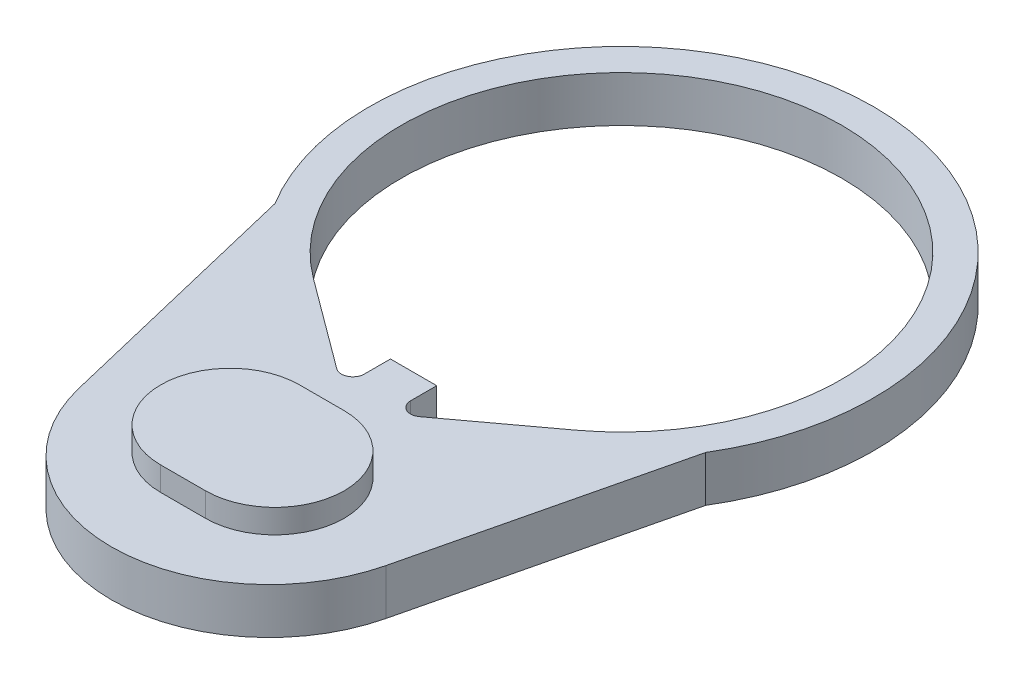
ISO-10303-21;
HEADER;
FILE_DESCRIPTION(('STEP AP214'),'2;1');
FILE_NAME('part.step','',(''),(''),'','','');
FILE_SCHEMA(('AUTOMOTIVE_DESIGN { 1 0 10303 214 1 1 1 1 }'));
ENDSEC;
DATA;
#1=APPLICATION_CONTEXT('core data for automotive mechanical design processes');
#2=APPLICATION_PROTOCOL_DEFINITION('international standard','automotive_design',2000,#1);
#3=PRODUCT_CONTEXT('',#1,'mechanical');
#4=PRODUCT('Part','Part','',(#3));
#5=PRODUCT_RELATED_PRODUCT_CATEGORY('part','',(#4));
#6=PRODUCT_DEFINITION_FORMATION('','',#4);
#7=PRODUCT_DEFINITION_CONTEXT('part definition',#1,'design');
#8=PRODUCT_DEFINITION('design','',#6,#7);
#9=PRODUCT_DEFINITION_SHAPE('','',#8);
#10=(LENGTH_UNIT() NAMED_UNIT(*) SI_UNIT(.MILLI.,.METRE.));
#11=(NAMED_UNIT(*) PLANE_ANGLE_UNIT() SI_UNIT($,.RADIAN.));
#12=(NAMED_UNIT(*) SI_UNIT($,.STERADIAN.) SOLID_ANGLE_UNIT());
#13=UNCERTAINTY_MEASURE_WITH_UNIT(LENGTH_MEASURE(1.E-05),#10,'distance_accuracy_value','');
#14=(GEOMETRIC_REPRESENTATION_CONTEXT(3) GLOBAL_UNCERTAINTY_ASSIGNED_CONTEXT((#13)) GLOBAL_UNIT_ASSIGNED_CONTEXT((#10,
#11,#12)) REPRESENTATION_CONTEXT('',''));
#15=CARTESIAN_POINT('',(0.,0.,0.));
#16=DIRECTION('',(0.,0.,1.));
#17=DIRECTION('',(1.,0.,0.));
#18=AXIS2_PLACEMENT_3D('',#15,#16,#17);
#19=CARTESIAN_POINT('',(0.,3.1496,0.));
#20=DIRECTION('',(0.,1.,0.));
#21=DIRECTION('',(0.,0.,1.));
#22=AXIS2_PLACEMENT_3D('',#19,#20,#21);
#23=PLANE('',#22);
#24=CARTESIAN_POINT('',(0.,3.1496,0.));
#25=DIRECTION('',(0.,1.,0.));
#26=DIRECTION('',(0.,0.,1.));
#27=AXIS2_PLACEMENT_3D('',#24,#25,#26);
#28=CIRCLE('',#27,17.3150564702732);
#29=CARTESIAN_POINT('',(14.7896292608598,3.1496,9.00433489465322));
#30=VERTEX_POINT('',#29);
#31=CARTESIAN_POINT('',(-14.7896292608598,3.1496,9.00433489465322));
#32=VERTEX_POINT('',#31);
#33=EDGE_CURVE('E301',#30,#32,#28,.T.);
#34=ORIENTED_EDGE('',*,*,#33,.T.);
#35=DIRECTION('',(0.233445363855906,0.,0.972369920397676));
#36=VECTOR('',#35,1.);
#37=CARTESIAN_POINT('',(-14.7896292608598,3.1496,9.00433489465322));
#38=LINE('',#37,#36);
#39=CARTESIAN_POINT('',(-10.5374458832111,3.1496,26.7159533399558));
#40=VERTEX_POINT('',#39);
#41=EDGE_CURVE('E304',#32,#40,#38,.T.);
#42=ORIENTED_EDGE('',*,*,#41,.T.);
#43=CARTESIAN_POINT('',(0.,3.1496,24.1861364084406));
#44=DIRECTION('',(0.,1.,0.));
#45=DIRECTION('',(0.,0.,1.));
#46=AXIS2_PLACEMENT_3D('',#43,#44,#45);
#47=CIRCLE('',#46,10.8368694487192);
#48=CARTESIAN_POINT('',(10.5374458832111,3.1496,26.7159533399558));
#49=VERTEX_POINT('',#48);
#50=EDGE_CURVE('E307',#40,#49,#47,.T.);
#51=ORIENTED_EDGE('',*,*,#50,.T.);
#52=DIRECTION('',(0.233445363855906,0.,-0.972369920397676));
#53=VECTOR('',#52,1.);
#54=CARTESIAN_POINT('',(14.7896292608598,3.1496,9.00433489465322));
#55=LINE('',#54,#53);
#56=EDGE_CURVE('E309',#49,#30,#55,.T.);
#57=ORIENTED_EDGE('',*,*,#56,.T.);
#58=EDGE_LOOP('',(#34,#42,#51,#57));
#59=FACE_BOUND('',#58,.T.);
#60=DIRECTION('',(0.803856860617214,0.,0.594822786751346));
#61=VECTOR('',#60,1.);
#62=CARTESIAN_POINT('',(-2.84326346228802,3.1496,16.7011098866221));
#63=LINE('',#62,#61);
#64=CARTESIAN_POINT('',(-8.99166224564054,3.1496,12.1515341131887));
#65=VERTEX_POINT('',#64);
#66=CARTESIAN_POINT('',(-2.84326346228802,3.1496,16.7011098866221));
#67=VERTEX_POINT('',#66);
#68=EDGE_CURVE('E244',#65,#67,#63,.T.);
#69=ORIENTED_EDGE('',*,*,#68,.F.);
#70=CARTESIAN_POINT('',(0.,3.1496,0.));
#71=DIRECTION('',(0.,1.,0.));
#72=DIRECTION('',(0.,0.,1.));
#73=AXIS2_PLACEMENT_3D('',#70,#71,#72);
#74=CIRCLE('',#73,15.1165396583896);
#75=CARTESIAN_POINT('',(8.99166224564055,3.1496,12.1515341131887));
#76=VERTEX_POINT('',#75);
#77=EDGE_CURVE('E242',#76,#65,#74,.T.);
#78=ORIENTED_EDGE('',*,*,#77,.F.);
#79=DIRECTION('',(0.803856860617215,0.,-0.594822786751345));
#80=VECTOR('',#79,1.);
#81=CARTESIAN_POINT('',(2.84326346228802,3.1496,16.7011098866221));
#82=LINE('',#81,#80);
#83=CARTESIAN_POINT('',(2.84326346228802,3.1496,16.7011098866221));
#84=VERTEX_POINT('',#83);
#85=EDGE_CURVE('E258',#84,#76,#82,.T.);
#86=ORIENTED_EDGE('',*,*,#85,.F.);
#87=CARTESIAN_POINT('',(2.3749,3.1496,16.0681529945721));
#88=DIRECTION('',(0.,1.,0.));
#89=DIRECTION('',(0.,0.,1.));
#90=AXIS2_PLACEMENT_3D('',#87,#88,#89);
#91=CIRCLE('',#90,0.7874);
#92=CARTESIAN_POINT('',(1.5875,3.1496,16.0681529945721));
#93=VERTEX_POINT('',#92);
#94=EDGE_CURVE('E255',#93,#84,#91,.T.);
#95=ORIENTED_EDGE('',*,*,#94,.F.);
#96=DIRECTION('',(0.,0.,1.));
#97=VECTOR('',#96,1.);
#98=CARTESIAN_POINT('',(1.5875,3.1496,14.2712058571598));
#99=LINE('',#98,#97);
#100=CARTESIAN_POINT('',(1.5875,3.1496,14.2712058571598));
#101=VERTEX_POINT('',#100);
#102=EDGE_CURVE('E253',#101,#93,#99,.T.);
#103=ORIENTED_EDGE('',*,*,#102,.F.);
#104=DIRECTION('',(1.,0.,0.));
#105=VECTOR('',#104,1.);
#106=CARTESIAN_POINT('',(-1.5875,3.1496,14.2712058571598));
#107=LINE('',#106,#105);
#108=CARTESIAN_POINT('',(-1.5875,3.1496,14.2712058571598));
#109=VERTEX_POINT('',#108);
#110=EDGE_CURVE('E251',#109,#101,#107,.T.);
#111=ORIENTED_EDGE('',*,*,#110,.F.);
#112=DIRECTION('',(0.,0.,-1.));
#113=VECTOR('',#112,1.);
#114=CARTESIAN_POINT('',(-1.5875,3.1496,14.2712058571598));
#115=LINE('',#114,#113);
#116=CARTESIAN_POINT('',(-1.5875,3.1496,16.0681529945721));
#117=VERTEX_POINT('',#116);
#118=EDGE_CURVE('E249',#117,#109,#115,.T.);
#119=ORIENTED_EDGE('',*,*,#118,.F.);
#120=CARTESIAN_POINT('',(-2.3749,3.1496,16.0681529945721));
#121=DIRECTION('',(0.,1.,0.));
#122=DIRECTION('',(0.,0.,-1.));
#123=AXIS2_PLACEMENT_3D('',#120,#121,#122);
#124=CIRCLE('',#123,0.7874);
#125=EDGE_CURVE('E247',#67,#117,#124,.T.);
#126=ORIENTED_EDGE('',*,*,#125,.F.);
#127=EDGE_LOOP('',(#69,#78,#86,#95,#103,#111,#119,#126));
#128=FACE_BOUND('',#127,.T.);
#129=DIRECTION('',(1.,0.,0.));
#130=VECTOR('',#129,1.);
#131=CARTESIAN_POINT('',(-1.53669999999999,3.1496,30.0954058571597));
#132=LINE('',#131,#130);
#133=CARTESIAN_POINT('',(-1.53669999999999,3.1496,30.0954058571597));
#134=VERTEX_POINT('',#133);
#135=CARTESIAN_POINT('',(1.53669999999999,3.1496,30.0954058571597));
#136=VERTEX_POINT('',#135);
#137=EDGE_CURVE('E219',#134,#136,#132,.T.);
#138=ORIENTED_EDGE('',*,*,#137,.F.);
#139=CARTESIAN_POINT('',(-1.53669999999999,3.1496,25.3329058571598));
#140=DIRECTION('',(0.,1.,0.));
#141=DIRECTION('',(0.,0.,1.));
#142=AXIS2_PLACEMENT_3D('',#139,#140,#141);
#143=CIRCLE('',#142,4.7625);
#144=CARTESIAN_POINT('',(-1.53669999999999,3.1496,20.5704058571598));
#145=VERTEX_POINT('',#144);
#146=EDGE_CURVE('E223',#145,#134,#143,.T.);
#147=ORIENTED_EDGE('',*,*,#146,.F.);
#148=DIRECTION('',(-1.,0.,0.));
#149=VECTOR('',#148,1.);
#150=CARTESIAN_POINT('',(-1.53669999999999,3.1496,20.5704058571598));
#151=LINE('',#150,#149);
#152=CARTESIAN_POINT('',(1.53669999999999,3.1496,20.5704058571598));
#153=VERTEX_POINT('',#152);
#154=EDGE_CURVE('E212',#153,#145,#151,.T.);
#155=ORIENTED_EDGE('',*,*,#154,.F.);
#156=CARTESIAN_POINT('',(1.5367,3.1496,25.3329058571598));
#157=DIRECTION('',(0.,1.,0.));
#158=DIRECTION('',(0.,0.,1.));
#159=AXIS2_PLACEMENT_3D('',#156,#157,#158);
#160=CIRCLE('',#159,4.7625);
#161=EDGE_CURVE('E59',#136,#153,#160,.T.);
#162=ORIENTED_EDGE('',*,*,#161,.F.);
#163=EDGE_LOOP('',(#138,#147,#155,#162));
#164=FACE_BOUND('',#163,.T.);
#165=ADVANCED_FACE('F36',(#59,#128,#164),#23,.T.);
#166=CARTESIAN_POINT('',(0.,0.,0.));
#167=DIRECTION('',(0.,1.,0.));
#168=DIRECTION('',(0.,0.,1.));
#169=AXIS2_PLACEMENT_3D('',#166,#167,#168);
#170=PLANE('',#169);
#171=DIRECTION('',(1.,0.,0.));
#172=VECTOR('',#171,1.);
#173=CARTESIAN_POINT('',(-1.53669999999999,0.,20.4434058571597));
#174=LINE('',#173,#172);
#175=CARTESIAN_POINT('',(-1.53669999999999,0.,20.4434058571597));
#176=VERTEX_POINT('',#175);
#177=CARTESIAN_POINT('',(1.53669999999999,0.,20.4434058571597));
#178=VERTEX_POINT('',#177);
#179=EDGE_CURVE('E202',#176,#178,#174,.T.);
#180=ORIENTED_EDGE('',*,*,#179,.F.);
#181=CARTESIAN_POINT('',(-1.53669999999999,0.,25.3329058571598));
#182=DIRECTION('',(0.,-1.,0.));
#183=DIRECTION('',(0.,0.,-1.));
#184=AXIS2_PLACEMENT_3D('',#181,#182,#183);
#185=CIRCLE('',#184,4.8895);
#186=CARTESIAN_POINT('',(-1.53669999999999,0.,30.2224058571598));
#187=VERTEX_POINT('',#186);
#188=EDGE_CURVE('E51',#187,#176,#185,.T.);
#189=ORIENTED_EDGE('',*,*,#188,.F.);
#190=DIRECTION('',(-1.,0.,0.));
#191=VECTOR('',#190,1.);
#192=CARTESIAN_POINT('',(-1.53669999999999,0.,30.2224058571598));
#193=LINE('',#192,#191);
#194=CARTESIAN_POINT('',(1.53669999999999,0.,30.2224058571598));
#195=VERTEX_POINT('',#194);
#196=EDGE_CURVE('E193',#195,#187,#193,.T.);
#197=ORIENTED_EDGE('',*,*,#196,.F.);
#198=CARTESIAN_POINT('',(1.5367,0.,25.3329058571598));
#199=DIRECTION('',(0.,-1.,0.));
#200=DIRECTION('',(0.,0.,-1.));
#201=AXIS2_PLACEMENT_3D('',#198,#199,#200);
#202=CIRCLE('',#201,4.8895);
#203=EDGE_CURVE('E196',#178,#195,#202,.T.);
#204=ORIENTED_EDGE('',*,*,#203,.F.);
#205=EDGE_LOOP('',(#180,#189,#197,#204));
#206=FACE_BOUND('',#205,.T.);
#207=CARTESIAN_POINT('',(0.,0.,0.));
#208=DIRECTION('',(0.,1.,0.));
#209=DIRECTION('',(0.,0.,1.));
#210=AXIS2_PLACEMENT_3D('',#207,#208,#209);
#211=CIRCLE('',#210,17.3150564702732);
#212=CARTESIAN_POINT('',(14.7896292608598,0.,9.00433489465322));
#213=VERTEX_POINT('',#212);
#214=CARTESIAN_POINT('',(-14.7896292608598,0.,9.00433489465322));
#215=VERTEX_POINT('',#214);
#216=EDGE_CURVE('E300',#213,#215,#211,.T.);
#217=ORIENTED_EDGE('',*,*,#216,.F.);
#218=DIRECTION('',(0.233445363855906,0.,-0.972369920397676));
#219=VECTOR('',#218,1.);
#220=CARTESIAN_POINT('',(14.7896292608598,0.,9.00433489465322));
#221=LINE('',#220,#219);
#222=CARTESIAN_POINT('',(10.5374458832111,0.,26.7159533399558));
#223=VERTEX_POINT('',#222);
#224=EDGE_CURVE('E305',#223,#213,#221,.T.);
#225=ORIENTED_EDGE('',*,*,#224,.F.);
#226=CARTESIAN_POINT('',(0.,0.,24.1861364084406));
#227=DIRECTION('',(0.,1.,0.));
#228=DIRECTION('',(0.,0.,1.));
#229=AXIS2_PLACEMENT_3D('',#226,#227,#228);
#230=CIRCLE('',#229,10.8368694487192);
#231=CARTESIAN_POINT('',(-10.5374458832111,0.,26.7159533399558));
#232=VERTEX_POINT('',#231);
#233=EDGE_CURVE('E316',#232,#223,#230,.T.);
#234=ORIENTED_EDGE('',*,*,#233,.F.);
#235=DIRECTION('',(0.233445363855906,0.,0.972369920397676));
#236=VECTOR('',#235,1.);
#237=CARTESIAN_POINT('',(-14.7896292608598,0.,9.00433489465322));
#238=LINE('',#237,#236);
#239=EDGE_CURVE('E314',#215,#232,#238,.T.);
#240=ORIENTED_EDGE('',*,*,#239,.F.);
#241=EDGE_LOOP('',(#217,#225,#234,#240));
#242=FACE_BOUND('',#241,.T.);
#243=CARTESIAN_POINT('',(0.,0.,0.));
#244=DIRECTION('',(0.,1.,0.));
#245=DIRECTION('',(0.,0.,1.));
#246=AXIS2_PLACEMENT_3D('',#243,#244,#245);
#247=CIRCLE('',#246,15.1165396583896);
#248=CARTESIAN_POINT('',(8.99166224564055,0.,12.1515341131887));
#249=VERTEX_POINT('',#248);
#250=CARTESIAN_POINT('',(-8.99166224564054,0.,12.1515341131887));
#251=VERTEX_POINT('',#250);
#252=EDGE_CURVE('E229',#249,#251,#247,.T.);
#253=ORIENTED_EDGE('',*,*,#252,.T.);
#254=DIRECTION('',(0.803856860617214,0.,0.594822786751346));
#255=VECTOR('',#254,1.);
#256=CARTESIAN_POINT('',(-2.84326346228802,0.,16.7011098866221));
#257=LINE('',#256,#255);
#258=CARTESIAN_POINT('',(-2.84326346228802,0.,16.7011098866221));
#259=VERTEX_POINT('',#258);
#260=EDGE_CURVE('E263',#251,#259,#257,.T.);
#261=ORIENTED_EDGE('',*,*,#260,.T.);
#262=CARTESIAN_POINT('',(-2.3749,0.,16.0681529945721));
#263=DIRECTION('',(0.,1.,0.));
#264=DIRECTION('',(0.,0.,-1.));
#265=AXIS2_PLACEMENT_3D('',#262,#263,#264);
#266=CIRCLE('',#265,0.7874);
#267=CARTESIAN_POINT('',(-1.5875,0.,16.0681529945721));
#268=VERTEX_POINT('',#267);
#269=EDGE_CURVE('E266',#259,#268,#266,.T.);
#270=ORIENTED_EDGE('',*,*,#269,.T.);
#271=DIRECTION('',(0.,0.,-1.));
#272=VECTOR('',#271,1.);
#273=CARTESIAN_POINT('',(-1.5875,0.,14.2712058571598));
#274=LINE('',#273,#272);
#275=CARTESIAN_POINT('',(-1.5875,0.,14.2712058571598));
#276=VERTEX_POINT('',#275);
#277=EDGE_CURVE('E269',#268,#276,#274,.T.);
#278=ORIENTED_EDGE('',*,*,#277,.T.);
#279=DIRECTION('',(1.,0.,0.));
#280=VECTOR('',#279,1.);
#281=CARTESIAN_POINT('',(-1.5875,0.,14.2712058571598));
#282=LINE('',#281,#280);
#283=CARTESIAN_POINT('',(1.5875,0.,14.2712058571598));
#284=VERTEX_POINT('',#283);
#285=EDGE_CURVE('E272',#276,#284,#282,.T.);
#286=ORIENTED_EDGE('',*,*,#285,.T.);
#287=DIRECTION('',(0.,0.,1.));
#288=VECTOR('',#287,1.);
#289=CARTESIAN_POINT('',(1.5875,0.,14.2712058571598));
#290=LINE('',#289,#288);
#291=CARTESIAN_POINT('',(1.5875,0.,16.0681529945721));
#292=VERTEX_POINT('',#291);
#293=EDGE_CURVE('E275',#284,#292,#290,.T.);
#294=ORIENTED_EDGE('',*,*,#293,.T.);
#295=CARTESIAN_POINT('',(2.3749,0.,16.0681529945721));
#296=DIRECTION('',(0.,1.,0.));
#297=DIRECTION('',(0.,0.,1.));
#298=AXIS2_PLACEMENT_3D('',#295,#296,#297);
#299=CIRCLE('',#298,0.7874);
#300=CARTESIAN_POINT('',(2.84326346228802,0.,16.7011098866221));
#301=VERTEX_POINT('',#300);
#302=EDGE_CURVE('E278',#292,#301,#299,.T.);
#303=ORIENTED_EDGE('',*,*,#302,.T.);
#304=DIRECTION('',(0.803856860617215,0.,-0.594822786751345));
#305=VECTOR('',#304,1.);
#306=CARTESIAN_POINT('',(2.84326346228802,0.,16.7011098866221));
#307=LINE('',#306,#305);
#308=EDGE_CURVE('E245',#301,#249,#307,.T.);
#309=ORIENTED_EDGE('',*,*,#308,.T.);
#310=EDGE_LOOP('',(#253,#261,#270,#278,#286,#294,#303,#309));
#311=FACE_BOUND('',#310,.T.);
#312=ADVANCED_FACE('F334',(#206,#242,#311),#170,.F.);
#313=CARTESIAN_POINT('',(0.,3.1496,0.));
#314=DIRECTION('',(0.,-1.,0.));
#315=DIRECTION('',(0.,0.,-1.));
#316=AXIS2_PLACEMENT_3D('',#313,#314,#315);
#317=CYLINDRICAL_SURFACE('',#316,17.3150564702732);
#318=ORIENTED_EDGE('',*,*,#216,.T.);
#319=DIRECTION('',(0.,-1.,0.));
#320=VECTOR('',#319,1.);
#321=CARTESIAN_POINT('',(-14.7896292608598,3.1496,9.00433489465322));
#322=LINE('',#321,#320);
#323=EDGE_CURVE('E12',#32,#215,#322,.T.);
#324=ORIENTED_EDGE('',*,*,#323,.F.);
#325=ORIENTED_EDGE('',*,*,#33,.F.);
#326=DIRECTION('',(0.,-1.,0.));
#327=VECTOR('',#326,1.);
#328=CARTESIAN_POINT('',(14.7896292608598,3.1496,9.00433489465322));
#329=LINE('',#328,#327);
#330=EDGE_CURVE('E311',#30,#213,#329,.T.);
#331=ORIENTED_EDGE('',*,*,#330,.T.);
#332=EDGE_LOOP('',(#318,#324,#325,#331));
#333=FACE_BOUND('',#332,.T.);
#334=ADVANCED_FACE('F38',(#333),#317,.T.);
#335=CARTESIAN_POINT('',(-14.7896292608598,3.1496,9.00433489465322));
#336=DIRECTION('',(0.972369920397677,0.,-0.233445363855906));
#337=DIRECTION('',(-0.233445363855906,0.,-0.972369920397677));
#338=AXIS2_PLACEMENT_3D('',#335,#336,#337);
#339=PLANE('',#338);
#340=ORIENTED_EDGE('',*,*,#239,.T.);
#341=DIRECTION('',(0.,-1.,0.));
#342=VECTOR('',#341,1.);
#343=CARTESIAN_POINT('',(-10.5374458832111,3.1496,26.7159533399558));
#344=LINE('',#343,#342);
#345=EDGE_CURVE('E44',#40,#232,#344,.T.);
#346=ORIENTED_EDGE('',*,*,#345,.F.);
#347=ORIENTED_EDGE('',*,*,#41,.F.);
#348=ORIENTED_EDGE('',*,*,#323,.T.);
#349=EDGE_LOOP('',(#340,#346,#347,#348));
#350=FACE_BOUND('',#349,.T.);
#351=ADVANCED_FACE('F345',(#350),#339,.F.);
#352=CARTESIAN_POINT('',(0.,3.1496,24.1861364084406));
#353=DIRECTION('',(0.,-1.,0.));
#354=DIRECTION('',(0.,0.,-1.));
#355=AXIS2_PLACEMENT_3D('',#352,#353,#354);
#356=CYLINDRICAL_SURFACE('',#355,10.8368694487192);
#357=ORIENTED_EDGE('',*,*,#233,.T.);
#358=DIRECTION('',(0.,-1.,0.));
#359=VECTOR('',#358,1.);
#360=CARTESIAN_POINT('',(10.5374458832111,3.1496,26.7159533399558));
#361=LINE('',#360,#359);
#362=EDGE_CURVE('E321',#49,#223,#361,.T.);
#363=ORIENTED_EDGE('',*,*,#362,.F.);
#364=ORIENTED_EDGE('',*,*,#50,.F.);
#365=ORIENTED_EDGE('',*,*,#345,.T.);
#366=EDGE_LOOP('',(#357,#363,#364,#365));
#367=FACE_BOUND('',#366,.T.);
#368=ADVANCED_FACE('F328',(#367),#356,.T.);
#369=CARTESIAN_POINT('',(14.7896292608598,3.1496,9.00433489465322));
#370=DIRECTION('',(-0.972369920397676,0.,-0.233445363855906));
#371=DIRECTION('',(-0.233445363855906,0.,0.972369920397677));
#372=AXIS2_PLACEMENT_3D('',#369,#370,#371);
#373=PLANE('',#372);
#374=ORIENTED_EDGE('',*,*,#224,.T.);
#375=ORIENTED_EDGE('',*,*,#330,.F.);
#376=ORIENTED_EDGE('',*,*,#56,.F.);
#377=ORIENTED_EDGE('',*,*,#362,.T.);
#378=EDGE_LOOP('',(#374,#375,#376,#377));
#379=FACE_BOUND('',#378,.T.);
#380=ADVANCED_FACE('F338',(#379),#373,.F.);
#381=CARTESIAN_POINT('',(0.,3.1496,0.));
#382=DIRECTION('',(0.,-1.,0.));
#383=DIRECTION('',(0.,0.,-1.));
#384=AXIS2_PLACEMENT_3D('',#381,#382,#383);
#385=CYLINDRICAL_SURFACE('',#384,15.1165396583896);
#386=ORIENTED_EDGE('',*,*,#252,.F.);
#387=DIRECTION('',(0.,-1.,0.));
#388=VECTOR('',#387,1.);
#389=CARTESIAN_POINT('',(8.99166224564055,3.1496,12.1515341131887));
#390=LINE('',#389,#388);
#391=EDGE_CURVE('E260',#76,#249,#390,.T.);
#392=ORIENTED_EDGE('',*,*,#391,.F.);
#393=ORIENTED_EDGE('',*,*,#77,.T.);
#394=DIRECTION('',(0.,-1.,0.));
#395=VECTOR('',#394,1.);
#396=CARTESIAN_POINT('',(-8.99166224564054,3.1496,12.1515341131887));
#397=LINE('',#396,#395);
#398=EDGE_CURVE('E297',#65,#251,#397,.T.);
#399=ORIENTED_EDGE('',*,*,#398,.T.);
#400=EDGE_LOOP('',(#386,#392,#393,#399));
#401=FACE_BOUND('',#400,.T.);
#402=ADVANCED_FACE('F360',(#401),#385,.F.);
#403=CARTESIAN_POINT('',(-2.84326346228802,3.1496,16.7011098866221));
#404=DIRECTION('',(0.594822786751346,0.,-0.803856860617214));
#405=DIRECTION('',(-0.803856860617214,0.,-0.594822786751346));
#406=AXIS2_PLACEMENT_3D('',#403,#404,#405);
#407=PLANE('',#406);
#408=ORIENTED_EDGE('',*,*,#260,.F.);
#409=ORIENTED_EDGE('',*,*,#398,.F.);
#410=ORIENTED_EDGE('',*,*,#68,.T.);
#411=DIRECTION('',(0.,-1.,0.));
#412=VECTOR('',#411,1.);
#413=CARTESIAN_POINT('',(-2.84326346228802,3.1496,16.7011098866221));
#414=LINE('',#413,#412);
#415=EDGE_CURVE('E295',#67,#259,#414,.T.);
#416=ORIENTED_EDGE('',*,*,#415,.T.);
#417=EDGE_LOOP('',(#408,#409,#410,#416));
#418=FACE_BOUND('',#417,.T.);
#419=ADVANCED_FACE('F367',(#418),#407,.T.);
#420=CARTESIAN_POINT('',(-2.3749,3.1496,16.0681529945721));
#421=DIRECTION('',(0.,-1.,0.));
#422=DIRECTION('',(0.,0.,-1.));
#423=AXIS2_PLACEMENT_3D('',#420,#421,#422);
#424=CYLINDRICAL_SURFACE('',#423,0.7874);
#425=ORIENTED_EDGE('',*,*,#269,.F.);
#426=ORIENTED_EDGE('',*,*,#415,.F.);
#427=ORIENTED_EDGE('',*,*,#125,.T.);
#428=DIRECTION('',(0.,-1.,0.));
#429=VECTOR('',#428,1.);
#430=CARTESIAN_POINT('',(-1.5875,3.1496,16.0681529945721));
#431=LINE('',#430,#429);
#432=EDGE_CURVE('E293',#117,#268,#431,.T.);
#433=ORIENTED_EDGE('',*,*,#432,.T.);
#434=EDGE_LOOP('',(#425,#426,#427,#433));
#435=FACE_BOUND('',#434,.T.);
#436=ADVANCED_FACE('F372',(#435),#424,.F.);
#437=CARTESIAN_POINT('',(-1.5875,3.1496,14.2712058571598));
#438=DIRECTION('',(-1.,0.,0.));
#439=DIRECTION('',(0.,0.,1.));
#440=AXIS2_PLACEMENT_3D('',#437,#438,#439);
#441=PLANE('',#440);
#442=ORIENTED_EDGE('',*,*,#277,.F.);
#443=ORIENTED_EDGE('',*,*,#432,.F.);
#444=ORIENTED_EDGE('',*,*,#118,.T.);
#445=DIRECTION('',(0.,-1.,0.));
#446=VECTOR('',#445,1.);
#447=CARTESIAN_POINT('',(-1.5875,3.1496,14.2712058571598));
#448=LINE('',#447,#446);
#449=EDGE_CURVE('E291',#109,#276,#448,.T.);
#450=ORIENTED_EDGE('',*,*,#449,.T.);
#451=EDGE_LOOP('',(#442,#443,#444,#450));
#452=FACE_BOUND('',#451,.T.);
#453=ADVANCED_FACE('F398',(#452),#441,.T.);
#454=CARTESIAN_POINT('',(-1.5875,3.1496,14.2712058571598));
#455=DIRECTION('',(0.,0.,-1.));
#456=DIRECTION('',(-1.,0.,0.));
#457=AXIS2_PLACEMENT_3D('',#454,#455,#456);
#458=PLANE('',#457);
#459=ORIENTED_EDGE('',*,*,#285,.F.);
#460=ORIENTED_EDGE('',*,*,#449,.F.);
#461=ORIENTED_EDGE('',*,*,#110,.T.);
#462=DIRECTION('',(0.,-1.,0.));
#463=VECTOR('',#462,1.);
#464=CARTESIAN_POINT('',(1.5875,3.1496,14.2712058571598));
#465=LINE('',#464,#463);
#466=EDGE_CURVE('E289',#101,#284,#465,.T.);
#467=ORIENTED_EDGE('',*,*,#466,.T.);
#468=EDGE_LOOP('',(#459,#460,#461,#467));
#469=FACE_BOUND('',#468,.T.);
#470=ADVANCED_FACE('F403',(#469),#458,.T.);
#471=CARTESIAN_POINT('',(1.5875,3.1496,14.2712058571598));
#472=DIRECTION('',(1.,0.,0.));
#473=DIRECTION('',(0.,0.,-1.));
#474=AXIS2_PLACEMENT_3D('',#471,#472,#473);
#475=PLANE('',#474);
#476=ORIENTED_EDGE('',*,*,#293,.F.);
#477=ORIENTED_EDGE('',*,*,#466,.F.);
#478=ORIENTED_EDGE('',*,*,#102,.T.);
#479=DIRECTION('',(0.,-1.,0.));
#480=VECTOR('',#479,1.);
#481=CARTESIAN_POINT('',(1.5875,3.1496,16.0681529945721));
#482=LINE('',#481,#480);
#483=EDGE_CURVE('E287',#93,#292,#482,.T.);
#484=ORIENTED_EDGE('',*,*,#483,.T.);
#485=EDGE_LOOP('',(#476,#477,#478,#484));
#486=FACE_BOUND('',#485,.T.);
#487=ADVANCED_FACE('F406',(#486),#475,.T.);
#488=CARTESIAN_POINT('',(2.3749,3.1496,16.0681529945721));
#489=DIRECTION('',(0.,-1.,0.));
#490=DIRECTION('',(0.,0.,-1.));
#491=AXIS2_PLACEMENT_3D('',#488,#489,#490);
#492=CYLINDRICAL_SURFACE('',#491,0.7874);
#493=ORIENTED_EDGE('',*,*,#302,.F.);
#494=ORIENTED_EDGE('',*,*,#483,.F.);
#495=ORIENTED_EDGE('',*,*,#94,.T.);
#496=DIRECTION('',(0.,-1.,0.));
#497=VECTOR('',#496,1.);
#498=CARTESIAN_POINT('',(2.84326346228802,3.1496,16.7011098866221));
#499=LINE('',#498,#497);
#500=EDGE_CURVE('E285',#84,#301,#499,.T.);
#501=ORIENTED_EDGE('',*,*,#500,.T.);
#502=EDGE_LOOP('',(#493,#494,#495,#501));
#503=FACE_BOUND('',#502,.T.);
#504=ADVANCED_FACE('F385',(#503),#492,.F.);
#505=CARTESIAN_POINT('',(2.84326346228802,3.1496,16.7011098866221));
#506=DIRECTION('',(-0.594822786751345,0.,-0.803856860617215));
#507=DIRECTION('',(-0.803856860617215,0.,0.594822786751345));
#508=AXIS2_PLACEMENT_3D('',#505,#506,#507);
#509=PLANE('',#508);
#510=ORIENTED_EDGE('',*,*,#308,.F.);
#511=ORIENTED_EDGE('',*,*,#500,.F.);
#512=ORIENTED_EDGE('',*,*,#85,.T.);
#513=ORIENTED_EDGE('',*,*,#391,.T.);
#514=EDGE_LOOP('',(#510,#511,#512,#513));
#515=FACE_BOUND('',#514,.T.);
#516=ADVANCED_FACE('F379',(#515),#509,.T.);
#517=CARTESIAN_POINT('',(-1.53669999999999,25.369637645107,25.3329058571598));
#518=DIRECTION('',(0.,-1.,0.));
#519=DIRECTION('',(0.,0.,-1.));
#520=AXIS2_PLACEMENT_3D('',#517,#518,#519);
#521=CYLINDRICAL_SURFACE('',#520,4.7625);
#522=CARTESIAN_POINT('',(-1.53669999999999,4.7879,25.3329058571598));
#523=DIRECTION('',(0.,1.,0.));
#524=DIRECTION('',(0.,0.,1.));
#525=AXIS2_PLACEMENT_3D('',#522,#523,#524);
#526=CIRCLE('',#525,4.7625);
#527=CARTESIAN_POINT('',(-1.53669999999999,4.7879,20.5704058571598));
#528=VERTEX_POINT('',#527);
#529=CARTESIAN_POINT('',(-1.53669999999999,4.7879,30.0954058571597));
#530=VERTEX_POINT('',#529);
#531=EDGE_CURVE('E233',#528,#530,#526,.T.);
#532=ORIENTED_EDGE('',*,*,#531,.F.);
#533=DIRECTION('',(0.,-1.,0.));
#534=VECTOR('',#533,1.);
#535=CARTESIAN_POINT('',(-1.53669999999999,25.369637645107,20.5704058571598));
#536=LINE('',#535,#534);
#537=EDGE_CURVE('E208',#528,#145,#536,.T.);
#538=ORIENTED_EDGE('',*,*,#537,.T.);
#539=ORIENTED_EDGE('',*,*,#146,.T.);
#540=DIRECTION('',(0.,-1.,0.));
#541=VECTOR('',#540,1.);
#542=CARTESIAN_POINT('',(-1.53669999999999,25.369637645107,30.0954058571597));
#543=LINE('',#542,#541);
#544=EDGE_CURVE('E222',#530,#134,#543,.T.);
#545=ORIENTED_EDGE('',*,*,#544,.F.);
#546=EDGE_LOOP('',(#532,#538,#539,#545));
#547=FACE_BOUND('',#546,.T.);
#548=ADVANCED_FACE('F450',(#547),#521,.T.);
#549=CARTESIAN_POINT('',(-1.53669999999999,25.369637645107,30.0954058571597));
#550=DIRECTION('',(0.,0.,-1.));
#551=DIRECTION('',(-1.,0.,0.));
#552=AXIS2_PLACEMENT_3D('',#549,#550,#551);
#553=PLANE('',#552);
#554=DIRECTION('',(1.,0.,0.));
#555=VECTOR('',#554,1.);
#556=CARTESIAN_POINT('',(-1.53669999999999,4.7879,30.0954058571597));
#557=LINE('',#556,#555);
#558=CARTESIAN_POINT('',(1.53669999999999,4.7879,30.0954058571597));
#559=VERTEX_POINT('',#558);
#560=EDGE_CURVE('E230',#530,#559,#557,.T.);
#561=ORIENTED_EDGE('',*,*,#560,.F.);
#562=ORIENTED_EDGE('',*,*,#544,.T.);
#563=ORIENTED_EDGE('',*,*,#137,.T.);
#564=DIRECTION('',(0.,-1.,0.));
#565=VECTOR('',#564,1.);
#566=CARTESIAN_POINT('',(1.53669999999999,25.369637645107,30.0954058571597));
#567=LINE('',#566,#565);
#568=EDGE_CURVE('E218',#559,#136,#567,.T.);
#569=ORIENTED_EDGE('',*,*,#568,.F.);
#570=EDGE_LOOP('',(#561,#562,#563,#569));
#571=FACE_BOUND('',#570,.T.);
#572=ADVANCED_FACE('F463',(#571),#553,.F.);
#573=CARTESIAN_POINT('',(1.5367,25.369637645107,25.3329058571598));
#574=DIRECTION('',(0.,-1.,0.));
#575=DIRECTION('',(0.,0.,-1.));
#576=AXIS2_PLACEMENT_3D('',#573,#574,#575);
#577=CYLINDRICAL_SURFACE('',#576,4.7625);
#578=CARTESIAN_POINT('',(1.5367,4.7879,25.3329058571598));
#579=DIRECTION('',(0.,1.,0.));
#580=DIRECTION('',(0.,0.,1.));
#581=AXIS2_PLACEMENT_3D('',#578,#579,#580);
#582=CIRCLE('',#581,4.7625);
#583=CARTESIAN_POINT('',(1.53669999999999,4.7879,20.5704058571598));
#584=VERTEX_POINT('',#583);
#585=EDGE_CURVE('E226',#559,#584,#582,.T.);
#586=ORIENTED_EDGE('',*,*,#585,.F.);
#587=ORIENTED_EDGE('',*,*,#568,.T.);
#588=ORIENTED_EDGE('',*,*,#161,.T.);
#589=DIRECTION('',(0.,-1.,0.));
#590=VECTOR('',#589,1.);
#591=CARTESIAN_POINT('',(1.53669999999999,25.369637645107,20.5704058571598));
#592=LINE('',#591,#590);
#593=EDGE_CURVE('E216',#584,#153,#592,.T.);
#594=ORIENTED_EDGE('',*,*,#593,.F.);
#595=EDGE_LOOP('',(#586,#587,#588,#594));
#596=FACE_BOUND('',#595,.T.);
#597=ADVANCED_FACE('F473',(#596),#577,.T.);
#598=CARTESIAN_POINT('',(-1.53669999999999,25.369637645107,20.5704058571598));
#599=DIRECTION('',(0.,0.,1.));
#600=DIRECTION('',(1.,0.,0.));
#601=AXIS2_PLACEMENT_3D('',#598,#599,#600);
#602=PLANE('',#601);
#603=DIRECTION('',(-1.,0.,0.));
#604=VECTOR('',#603,1.);
#605=CARTESIAN_POINT('',(-1.53669999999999,4.7879,20.5704058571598));
#606=LINE('',#605,#604);
#607=EDGE_CURVE('E215',#584,#528,#606,.T.);
#608=ORIENTED_EDGE('',*,*,#607,.F.);
#609=ORIENTED_EDGE('',*,*,#593,.T.);
#610=ORIENTED_EDGE('',*,*,#154,.T.);
#611=ORIENTED_EDGE('',*,*,#537,.F.);
#612=EDGE_LOOP('',(#608,#609,#610,#611));
#613=FACE_BOUND('',#612,.T.);
#614=ADVANCED_FACE('F483',(#613),#602,.F.);
#615=CARTESIAN_POINT('',(0.,4.7879,0.));
#616=DIRECTION('',(0.,1.,0.));
#617=DIRECTION('',(0.,0.,1.));
#618=AXIS2_PLACEMENT_3D('',#615,#616,#617);
#619=PLANE('',#618);
#620=ORIENTED_EDGE('',*,*,#607,.T.);
#621=ORIENTED_EDGE('',*,*,#531,.T.);
#622=ORIENTED_EDGE('',*,*,#560,.T.);
#623=ORIENTED_EDGE('',*,*,#585,.T.);
#624=EDGE_LOOP('',(#620,#621,#622,#623));
#625=FACE_BOUND('',#624,.T.);
#626=ADVANCED_FACE('F492',(#625),#619,.T.);
#627=CARTESIAN_POINT('',(-1.53669999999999,1.6002,25.3329058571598));
#628=DIRECTION('',(0.,-1.,0.));
#629=DIRECTION('',(0.,0.,-1.));
#630=AXIS2_PLACEMENT_3D('',#627,#628,#629);
#631=CYLINDRICAL_SURFACE('',#630,4.8895);
#632=ORIENTED_EDGE('',*,*,#188,.T.);
#633=DIRECTION('',(0.,-1.,0.));
#634=VECTOR('',#633,1.);
#635=CARTESIAN_POINT('',(-1.53669999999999,1.6002,20.4434058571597));
#636=LINE('',#635,#634);
#637=CARTESIAN_POINT('',(-1.53669999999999,1.6002,20.4434058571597));
#638=VERTEX_POINT('',#637);
#639=EDGE_CURVE('E171',#638,#176,#636,.T.);
#640=ORIENTED_EDGE('',*,*,#639,.F.);
#641=CARTESIAN_POINT('',(-1.53669999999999,1.6002,25.3329058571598));
#642=DIRECTION('',(0.,-1.,0.));
#643=DIRECTION('',(0.,0.,-1.));
#644=AXIS2_PLACEMENT_3D('',#641,#642,#643);
#645=CIRCLE('',#644,4.8895);
#646=CARTESIAN_POINT('',(-1.53669999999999,1.6002,30.2224058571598));
#647=VERTEX_POINT('',#646);
#648=EDGE_CURVE('E175',#647,#638,#645,.T.);
#649=ORIENTED_EDGE('',*,*,#648,.F.);
#650=DIRECTION('',(0.,-1.,0.));
#651=VECTOR('',#650,1.);
#652=CARTESIAN_POINT('',(-1.53669999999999,1.6002,30.2224058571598));
#653=LINE('',#652,#651);
#654=EDGE_CURVE('E206',#647,#187,#653,.T.);
#655=ORIENTED_EDGE('',*,*,#654,.T.);
#656=EDGE_LOOP('',(#632,#640,#649,#655));
#657=FACE_BOUND('',#656,.T.);
#658=ADVANCED_FACE('F173',(#657),#631,.F.);
#659=CARTESIAN_POINT('',(-1.53669999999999,1.6002,30.2224058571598));
#660=DIRECTION('',(0.,0.,1.));
#661=DIRECTION('',(1.,0.,0.));
#662=AXIS2_PLACEMENT_3D('',#659,#660,#661);
#663=PLANE('',#662);
#664=ORIENTED_EDGE('',*,*,#196,.T.);
#665=ORIENTED_EDGE('',*,*,#654,.F.);
#666=DIRECTION('',(-1.,0.,0.));
#667=VECTOR('',#666,1.);
#668=CARTESIAN_POINT('',(-1.53669999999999,1.6002,30.2224058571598));
#669=LINE('',#668,#667);
#670=CARTESIAN_POINT('',(1.53669999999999,1.6002,30.2224058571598));
#671=VERTEX_POINT('',#670);
#672=EDGE_CURVE('E181',#671,#647,#669,.T.);
#673=ORIENTED_EDGE('',*,*,#672,.F.);
#674=DIRECTION('',(0.,-1.,0.));
#675=VECTOR('',#674,1.);
#676=CARTESIAN_POINT('',(1.53669999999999,1.6002,30.2224058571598));
#677=LINE('',#676,#675);
#678=EDGE_CURVE('E209',#671,#195,#677,.T.);
#679=ORIENTED_EDGE('',*,*,#678,.T.);
#680=EDGE_LOOP('',(#664,#665,#673,#679));
#681=FACE_BOUND('',#680,.T.);
#682=ADVANCED_FACE('F518',(#681),#663,.F.);
#683=CARTESIAN_POINT('',(1.5367,1.6002,25.3329058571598));
#684=DIRECTION('',(0.,-1.,0.));
#685=DIRECTION('',(0.,0.,-1.));
#686=AXIS2_PLACEMENT_3D('',#683,#684,#685);
#687=CYLINDRICAL_SURFACE('',#686,4.8895);
#688=ORIENTED_EDGE('',*,*,#203,.T.);
#689=ORIENTED_EDGE('',*,*,#678,.F.);
#690=CARTESIAN_POINT('',(1.5367,1.6002,25.3329058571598));
#691=DIRECTION('',(0.,-1.,0.));
#692=DIRECTION('',(0.,0.,-1.));
#693=AXIS2_PLACEMENT_3D('',#690,#691,#692);
#694=CIRCLE('',#693,4.8895);
#695=CARTESIAN_POINT('',(1.53669999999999,1.6002,20.4434058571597));
#696=VERTEX_POINT('',#695);
#697=EDGE_CURVE('E189',#696,#671,#694,.T.);
#698=ORIENTED_EDGE('',*,*,#697,.F.);
#699=DIRECTION('',(0.,-1.,0.));
#700=VECTOR('',#699,1.);
#701=CARTESIAN_POINT('',(1.53669999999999,1.6002,20.4434058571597));
#702=LINE('',#701,#700);
#703=EDGE_CURVE('E180',#696,#178,#702,.T.);
#704=ORIENTED_EDGE('',*,*,#703,.T.);
#705=EDGE_LOOP('',(#688,#689,#698,#704));
#706=FACE_BOUND('',#705,.T.);
#707=ADVANCED_FACE('F527',(#706),#687,.F.);
#708=CARTESIAN_POINT('',(-1.53669999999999,1.6002,20.4434058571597));
#709=DIRECTION('',(0.,0.,-1.));
#710=DIRECTION('',(-1.,0.,0.));
#711=AXIS2_PLACEMENT_3D('',#708,#709,#710);
#712=PLANE('',#711);
#713=ORIENTED_EDGE('',*,*,#179,.T.);
#714=ORIENTED_EDGE('',*,*,#703,.F.);
#715=DIRECTION('',(1.,0.,0.));
#716=VECTOR('',#715,1.);
#717=CARTESIAN_POINT('',(-1.53669999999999,1.6002,20.4434058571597));
#718=LINE('',#717,#716);
#719=EDGE_CURVE('E184',#638,#696,#718,.T.);
#720=ORIENTED_EDGE('',*,*,#719,.F.);
#721=ORIENTED_EDGE('',*,*,#639,.T.);
#722=EDGE_LOOP('',(#713,#714,#720,#721));
#723=FACE_BOUND('',#722,.T.);
#724=ADVANCED_FACE('F185',(#723),#712,.F.);
#725=CARTESIAN_POINT('',(-1.53669999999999,1.6002,25.3329058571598));
#726=DIRECTION('',(0.,-1.,0.));
#727=DIRECTION('',(0.,0.,-1.));
#728=AXIS2_PLACEMENT_3D('',#725,#726,#727);
#729=PLANE('',#728);
#730=ORIENTED_EDGE('',*,*,#648,.T.);
#731=ORIENTED_EDGE('',*,*,#719,.T.);
#732=ORIENTED_EDGE('',*,*,#697,.T.);
#733=ORIENTED_EDGE('',*,*,#672,.T.);
#734=EDGE_LOOP('',(#730,#731,#732,#733));
#735=FACE_BOUND('',#734,.T.);
#736=ADVANCED_FACE('F191',(#735),#729,.T.);
#737=CLOSED_SHELL('',(#165,#312,#334,#351,#368,#380,#402,#419,#436,#453,#470,#487,#504,#516,
#548,#572,#597,#614,#626,#658,#682,#707,#724,#736));
#738=MANIFOLD_SOLID_BREP('B2',#737);
#739=ADVANCED_BREP_SHAPE_REPRESENTATION('',(#18,#738),#14);
#740=SHAPE_DEFINITION_REPRESENTATION(#9,#739);
ENDSEC;
END-ISO-10303-21;
